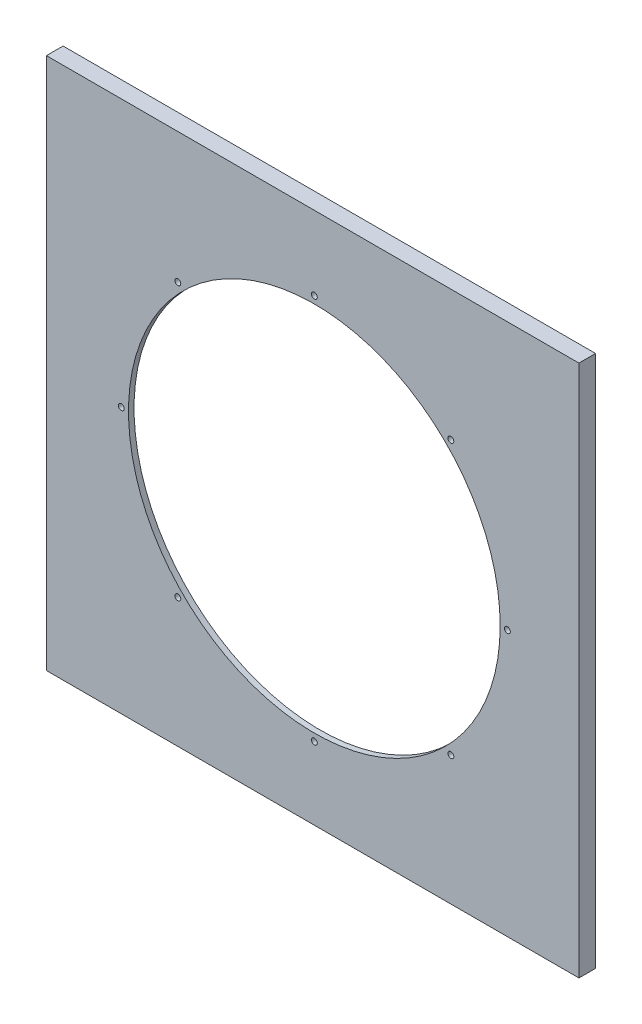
from build123d import *

# Parameters (mm, degrees)
SKETCH1_W           = 609.6
SKETCH1_H           = 609.6
BOSS_EXTRUDE1_DEPTH = 19.05
SKETCH2_R           = 3.3655
SKETCH2_R_2         = 212.725
CUT_EXTRUDE1_DEPTH  = 432.473037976
SKETCH3_R           = 249.2375
CUT_EXTRUDE2_DEPTH  = 12.7


with BuildPart() as part:
    # Sketch1 → Boss-Extrude1 (new body)
    with BuildSketch(Plane.XY):
        Rectangle(SKETCH1_W, SKETCH1_H)
    extrude(amount=BOSS_EXTRUDE1_DEPTH)

    # Sketch2 → Cut-Extrude1 (cut, through all)
    with BuildSketch(Plane.XY.offset(19.05)):
        with Locations((1.909125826, 220.236669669)):
            Circle(SKETCH2_R)
        with Locations((158.179950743, 155.507174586)):
            Circle(SKETCH2_R)
        with Locations((222.909445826, -0.763650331)):
            Circle(SKETCH2_R)
        with Locations((158.179950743, -157.034475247)):
            Circle(SKETCH2_R)
        with Locations((1.909125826, -221.763970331)):
            Circle(SKETCH2_R)
        with Locations((-154.36169909, -157.034475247)):
            Circle(SKETCH2_R)
        with Locations((-219.091194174, -0.763650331)):
            Circle(SKETCH2_R)
        with Locations((-154.36169909, 155.507174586)):
            Circle(SKETCH2_R)
        with Locations((1.909125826, -0.763650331)):
            Circle(SKETCH2_R_2)
    extrude(amount=-CUT_EXTRUDE1_DEPTH, mode=Mode.SUBTRACT)

    # Sketch3 → Cut-Extrude2 (cut)
    with BuildSketch(Plane(origin=(0, 0, 0), x_dir=(-1, 0, 0), z_dir=(0, 0, -1))):
        Circle(SKETCH3_R)
    extrude(amount=-CUT_EXTRUDE2_DEPTH, mode=Mode.SUBTRACT)


solid = part.part
